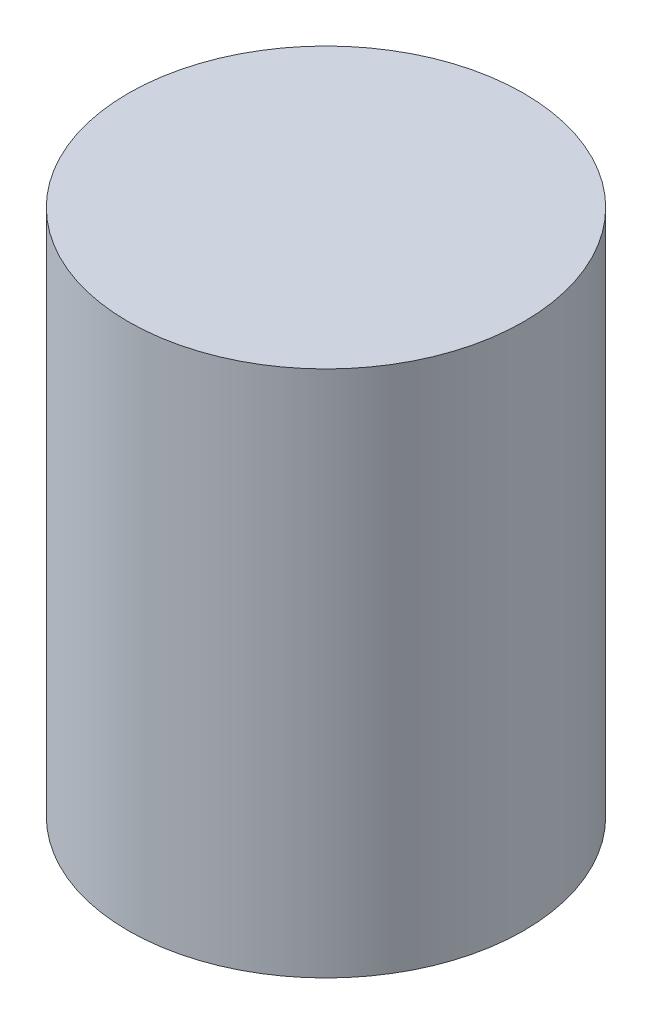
ISO-10303-21;
HEADER;
FILE_DESCRIPTION(('STEP AP214'),'2;1');
FILE_NAME('part.step','',(''),(''),'','','');
FILE_SCHEMA(('AUTOMOTIVE_DESIGN { 1 0 10303 214 1 1 1 1 }'));
ENDSEC;
DATA;
#1=APPLICATION_CONTEXT('core data for automotive mechanical design processes');
#2=APPLICATION_PROTOCOL_DEFINITION('international standard','automotive_design',2000,#1);
#3=PRODUCT_CONTEXT('',#1,'mechanical');
#4=PRODUCT('Part','Part','',(#3));
#5=PRODUCT_RELATED_PRODUCT_CATEGORY('part','',(#4));
#6=PRODUCT_DEFINITION_FORMATION('','',#4);
#7=PRODUCT_DEFINITION_CONTEXT('part definition',#1,'design');
#8=PRODUCT_DEFINITION('design','',#6,#7);
#9=PRODUCT_DEFINITION_SHAPE('','',#8);
#10=(LENGTH_UNIT() NAMED_UNIT(*) SI_UNIT(.MILLI.,.METRE.));
#11=(NAMED_UNIT(*) PLANE_ANGLE_UNIT() SI_UNIT($,.RADIAN.));
#12=(NAMED_UNIT(*) SI_UNIT($,.STERADIAN.) SOLID_ANGLE_UNIT());
#13=UNCERTAINTY_MEASURE_WITH_UNIT(LENGTH_MEASURE(1.E-05),#10,'distance_accuracy_value','');
#14=(GEOMETRIC_REPRESENTATION_CONTEXT(3) GLOBAL_UNCERTAINTY_ASSIGNED_CONTEXT((#13)) GLOBAL_UNIT_ASSIGNED_CONTEXT((#10,
#11,#12)) REPRESENTATION_CONTEXT('',''));
#15=CARTESIAN_POINT('',(0.,0.,0.));
#16=DIRECTION('',(0.,0.,1.));
#17=DIRECTION('',(1.,0.,0.));
#18=AXIS2_PLACEMENT_3D('',#15,#16,#17);
#19=CARTESIAN_POINT('',(0.,101.6,0.));
#20=DIRECTION('',(0.,-1.,0.));
#21=DIRECTION('',(0.,0.,-1.));
#22=AXIS2_PLACEMENT_3D('',#19,#20,#21);
#23=CYLINDRICAL_SURFACE('',#22,38.1);
#24=CARTESIAN_POINT('',(0.,101.6,0.));
#25=DIRECTION('',(0.,1.,0.));
#26=DIRECTION('',(0.,0.,1.));
#27=AXIS2_PLACEMENT_3D('',#24,#25,#26);
#28=CIRCLE('',#27,38.1);
#29=CARTESIAN_POINT('',(0.,101.6,38.1));
#30=VERTEX_POINT('',#29);
#31=EDGE_CURVE('E10',#30,#30,#28,.T.);
#32=ORIENTED_EDGE('',*,*,#31,.F.);
#33=EDGE_LOOP('',(#32));
#34=FACE_BOUND('',#33,.T.);
#35=CARTESIAN_POINT('',(0.,0.,0.));
#36=DIRECTION('',(0.,1.,0.));
#37=DIRECTION('',(0.,0.,1.));
#38=AXIS2_PLACEMENT_3D('',#35,#36,#37);
#39=CIRCLE('',#38,38.1);
#40=CARTESIAN_POINT('',(0.,0.,38.1));
#41=VERTEX_POINT('',#40);
#42=EDGE_CURVE('E38',#41,#41,#39,.T.);
#43=ORIENTED_EDGE('',*,*,#42,.T.);
#44=EDGE_LOOP('',(#43));
#45=FACE_BOUND('',#44,.T.);
#46=ADVANCED_FACE('F32',(#34,#45),#23,.T.);
#47=CARTESIAN_POINT('',(0.,101.6,0.));
#48=DIRECTION('',(0.,1.,0.));
#49=DIRECTION('',(0.,0.,1.));
#50=AXIS2_PLACEMENT_3D('',#47,#48,#49);
#51=PLANE('',#50);
#52=ORIENTED_EDGE('',*,*,#31,.T.);
#53=EDGE_LOOP('',(#52));
#54=FACE_BOUND('',#53,.T.);
#55=ADVANCED_FACE('F47',(#54),#51,.T.);
#56=CARTESIAN_POINT('',(0.,0.,0.));
#57=DIRECTION('',(0.,1.,0.));
#58=DIRECTION('',(0.,0.,1.));
#59=AXIS2_PLACEMENT_3D('',#56,#57,#58);
#60=PLANE('',#59);
#61=ORIENTED_EDGE('',*,*,#42,.F.);
#62=EDGE_LOOP('',(#61));
#63=FACE_BOUND('',#62,.T.);
#64=ADVANCED_FACE('F45',(#63),#60,.F.);
#65=CLOSED_SHELL('',(#46,#55,#64));
#66=MANIFOLD_SOLID_BREP('B2',#65);
#67=ADVANCED_BREP_SHAPE_REPRESENTATION('',(#18,#66),#14);
#68=SHAPE_DEFINITION_REPRESENTATION(#9,#67);
ENDSEC;
END-ISO-10303-21;
